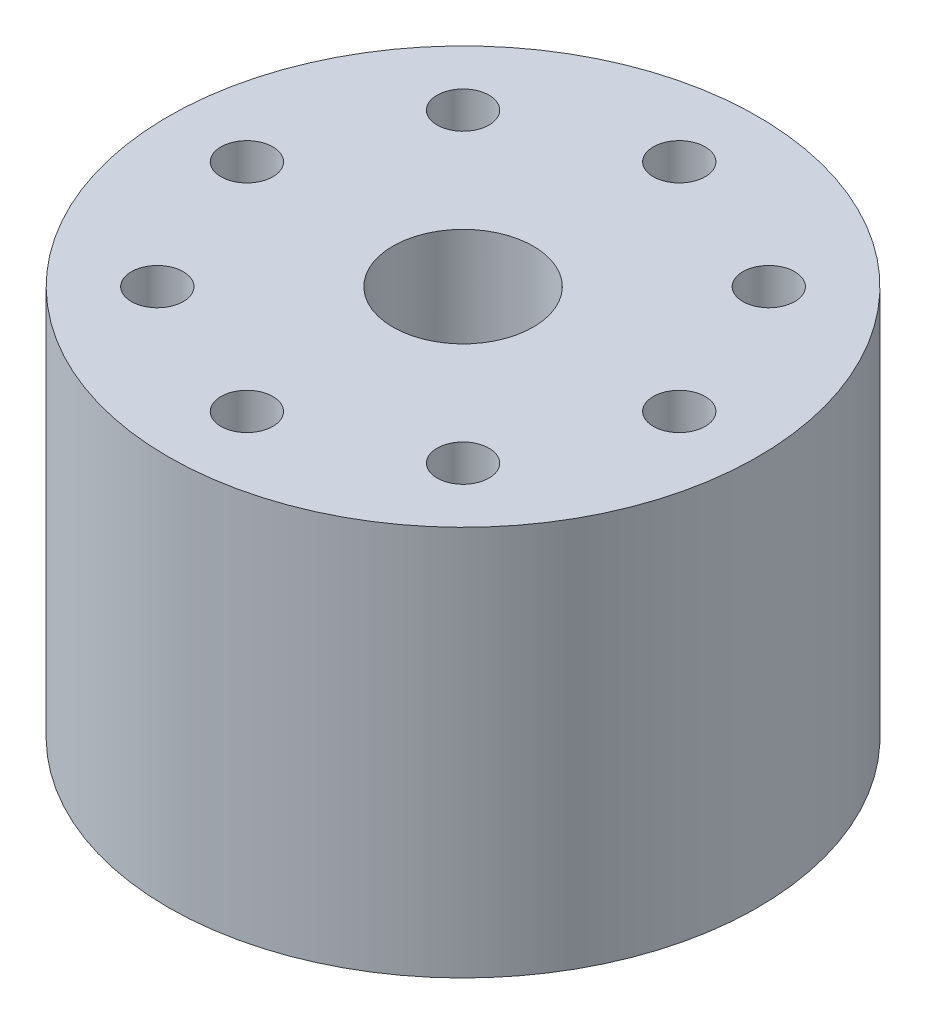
from build123d import *

# Parameters (mm, degrees)
SKETCH1_R                    = 37.5
OUTER_CYLINDER_DEPTH         = 49.65
SKETCH2_R                    = 8.93
NPT_HOLE_DEPTH               = 23
SKETCH3_R                    = 14
OUTER_LEAFLET_DIAMETER_DEPTH = 5
SKETCH4_R                    = 18
DEPTH_DEPTH                  = 3.15
SKETCH8_W                    = 14
SKETCH8_H                    = 3.62
SKETCH9_R                    = 3.3
BOLT_HOLES_DEPTH             = 73.647247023
CHAMFER3_SIZE                = 5
CHAMFER3_SIZE2               = 5.958767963


with BuildPart() as part:
    # Sketch1 → Outer Cylinder (new body)
    with BuildSketch(Plane(origin=(0, 0, 0), x_dir=(1, 0, 0), z_dir=(0, 1, 0))):
        with Locations(Location((0, 0, 0), (0, 0, 270))):
            Circle(SKETCH1_R)
    extrude(amount=OUTER_CYLINDER_DEPTH)

    # Sketch2 → NPT Hole (cut)
    with BuildSketch(Plane(origin=(0, 49.65, 0), x_dir=(1, 0, 0), z_dir=(0, 1, 0))):
        with Locations(Location((0, 0, 0), (0, 0, 270))):
            Circle(SKETCH2_R)
    extrude(amount=-NPT_HOLE_DEPTH, mode=Mode.SUBTRACT)

    # Sketch3 → Outer Leaflet Diameter (cut)
    with BuildSketch(Plane.XZ):
        with Locations(Location((0, 0, 0), (0, 0, 270))):
            Circle(SKETCH3_R)
    extrude(amount=-OUTER_LEAFLET_DIAMETER_DEPTH, mode=Mode.SUBTRACT)

    # Sketch4 → Depth (cut)
    with BuildSketch(Plane.XZ):
        with Locations(Location((0, 0, 0), (0, 0, 270))):
            Circle(SKETCH4_R)
    extrude(amount=-DEPTH_DEPTH, mode=Mode.SUBTRACT)

    # Sketch6 → Aortic Root (revolve, cut)
    with BuildSketch(Plane.XY):
        with BuildLine():
            Line((0, 3.15), (-14, 3.15))
            add(Edge.make_bspline(
                [(-14, 23.03), (-22.4, 13.09), (-14, 3.15)],
                knots=[0, 0, 0, 1, 1, 1], degree=2))
            Line((-14, 23.03), (0, 23.03))
            Line((0, 23.03), (0, 3.15))
        make_face()
    revolve(axis=Axis((0, 3.15, 0), (0, 1, 0)), mode=Mode.SUBTRACT)

    # Sketch8 → Ascending Aorta (revolve, cut)
    with BuildSketch(Plane.XY):
        with Locations((-7, 24.84)):
            Rectangle(SKETCH8_W, SKETCH8_H)
    revolve(axis=Axis((0, 26.65, 0), (0, -1, 0)), mode=Mode.SUBTRACT)

    # Sketch9 → Bolt Holes (cut, through all)
    with BuildSketch(Plane(origin=(0, 49.65, 0), x_dir=(1, 0, 0), z_dir=(0, 1, 0))):
        with Locations(Location((0, -27.5, 0), (0, 0, 270))):
            Circle(SKETCH9_R)
        with Locations(Location((-19.445436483, -19.445436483, 0), (0, 0, 270))):
            Circle(SKETCH9_R)
        with Locations(Location((-27.5, 0, 0), (0, 0, 270))):
            Circle(SKETCH9_R)
        with Locations(Location((-19.445436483, 19.445436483, 0), (0, 0, 270))):
            Circle(SKETCH9_R)
        with Locations(Location((0, 27.5, 0), (0, 0, 270))):
            Circle(SKETCH9_R)
        with Locations(Location((19.445436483, 19.445436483, 0), (0, 0, 270))):
            Circle(SKETCH9_R)
        with Locations(Location((27.5, 0, 0), (0, 0, 270))):
            Circle(SKETCH9_R)
        with Locations(Location((19.445436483, -19.445436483, 0), (0, 0, 270))):
            Circle(SKETCH9_R)
    extrude(amount=-BOLT_HOLES_DEPTH, mode=Mode.SUBTRACT)

    # Chamfer3
    chamfer3_edges = [part.edges().sort_by_distance(p)[0] for p in [
        (0, 26.65, -8.93),
    ]]
    chamfer3_side = [part.faces().sort_by_distance(p)[0] for p in [
        (13.604020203, 26.65, 0),
    ]]
    chamfer(chamfer3_edges, length=CHAMFER3_SIZE, length2=CHAMFER3_SIZE2, reference=chamfer3_side[0])


solid = part.part
